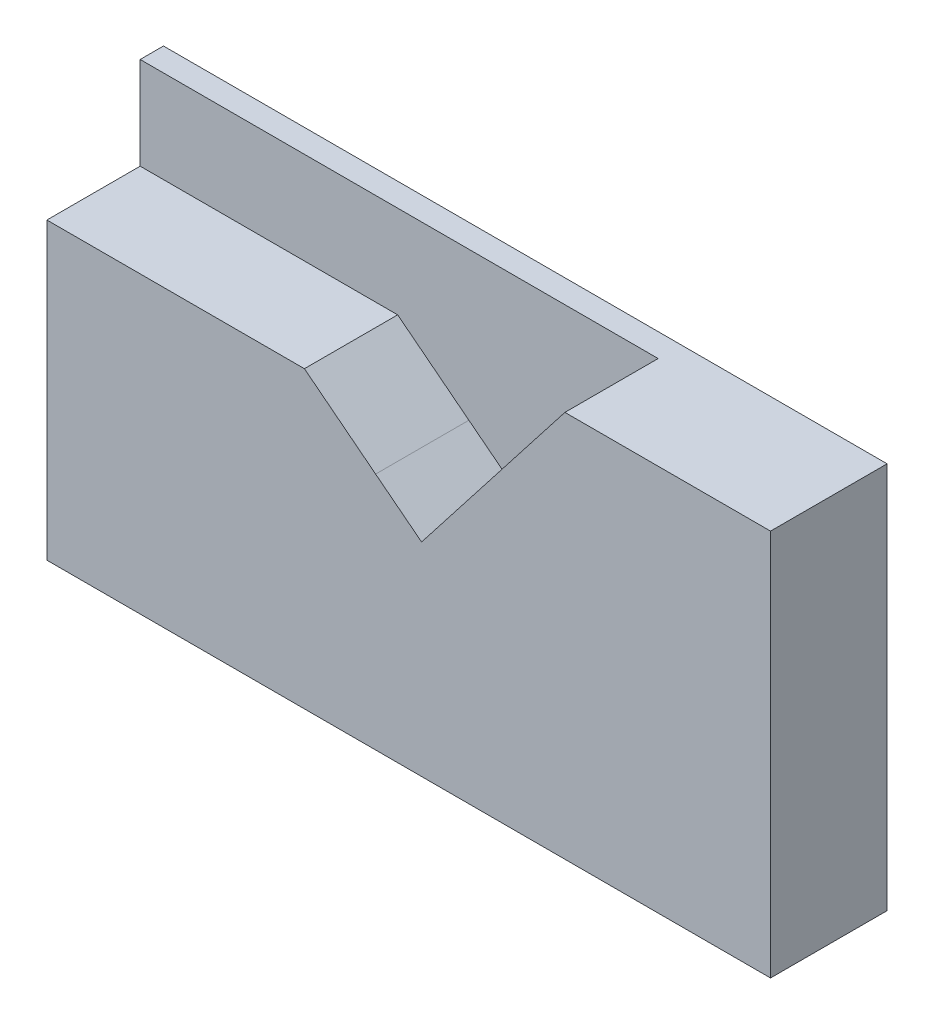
from build123d import *

# Parameters (mm, degrees)
SKETCH1_W          = 39.417424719
SKETCH1_H          = 21.082
EXTRUDE1_DEPTH     = 6.35
CUT_EXTRUDE1_DEPTH = 5.08


with BuildPart() as part:
    # Sketch1 → Extrude1 (new body)
    with BuildSketch(Plane.XY):
        with Locations((26.159667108, -5.861340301)):
            Rectangle(SKETCH1_W, SKETCH1_H)
    extrude(amount=EXTRUDE1_DEPTH)

    # Sketch5 → Cut-Extrude1 (cut)
    with BuildSketch(Plane.XY.offset(6.35)):
        Polygon((34.66764787, 4.679659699), (26.861368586, -5.337925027), (24.356972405, -3.386355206), (20.47871511, -0.353770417), (6.450954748, -0.353770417), (6.450954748, 4.679659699), align=None)
    extrude(amount=-CUT_EXTRUDE1_DEPTH, mode=Mode.SUBTRACT)


solid = part.part
